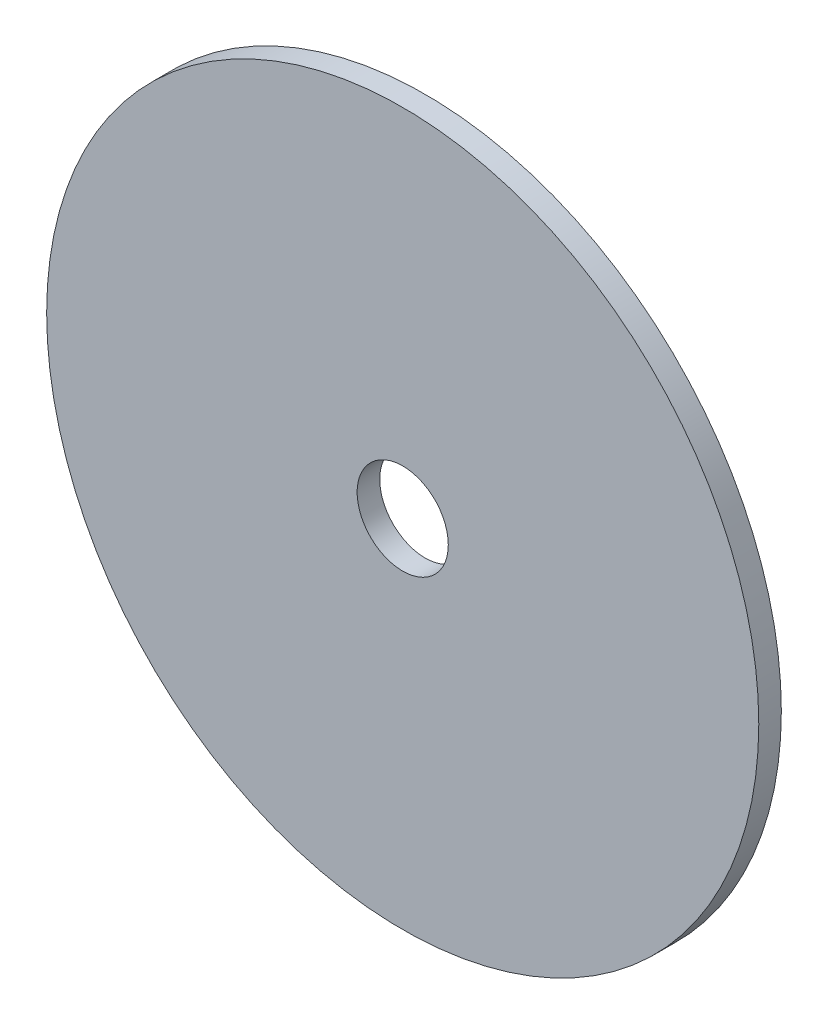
ISO-10303-21;
HEADER;
FILE_DESCRIPTION(('STEP AP214'),'2;1');
FILE_NAME('part.step','',(''),(''),'','','');
FILE_SCHEMA(('AUTOMOTIVE_DESIGN { 1 0 10303 214 1 1 1 1 }'));
ENDSEC;
DATA;
#1=APPLICATION_CONTEXT('core data for automotive mechanical design processes');
#2=APPLICATION_PROTOCOL_DEFINITION('international standard','automotive_design',2000,#1);
#3=PRODUCT_CONTEXT('',#1,'mechanical');
#4=PRODUCT('Part','Part','',(#3));
#5=PRODUCT_RELATED_PRODUCT_CATEGORY('part','',(#4));
#6=PRODUCT_DEFINITION_FORMATION('','',#4);
#7=PRODUCT_DEFINITION_CONTEXT('part definition',#1,'design');
#8=PRODUCT_DEFINITION('design','',#6,#7);
#9=PRODUCT_DEFINITION_SHAPE('','',#8);
#10=(LENGTH_UNIT() NAMED_UNIT(*) SI_UNIT(.MILLI.,.METRE.));
#11=(NAMED_UNIT(*) PLANE_ANGLE_UNIT() SI_UNIT($,.RADIAN.));
#12=(NAMED_UNIT(*) SI_UNIT($,.STERADIAN.) SOLID_ANGLE_UNIT());
#13=UNCERTAINTY_MEASURE_WITH_UNIT(LENGTH_MEASURE(1.E-05),#10,'distance_accuracy_value','');
#14=(GEOMETRIC_REPRESENTATION_CONTEXT(3) GLOBAL_UNCERTAINTY_ASSIGNED_CONTEXT((#13)) GLOBAL_UNIT_ASSIGNED_CONTEXT((#10,
#11,#12)) REPRESENTATION_CONTEXT('',''));
#15=CARTESIAN_POINT('',(0.,0.,0.));
#16=DIRECTION('',(0.,0.,1.));
#17=DIRECTION('',(1.,0.,0.));
#18=AXIS2_PLACEMENT_3D('',#15,#16,#17);
#19=CARTESIAN_POINT('',(0.,0.,1.5841));
#20=DIRECTION('',(0.,0.,1.));
#21=DIRECTION('',(1.,0.,0.));
#22=AXIS2_PLACEMENT_3D('',#19,#20,#21);
#23=PLANE('',#22);
#24=CARTESIAN_POINT('',(0.,0.,1.5841));
#25=DIRECTION('',(0.,0.,1.));
#26=DIRECTION('',(1.,0.,0.));
#27=AXIS2_PLACEMENT_3D('',#24,#25,#26);
#28=CIRCLE('',#27,25.);
#29=CARTESIAN_POINT('',(25.,0.,1.5841));
#30=VERTEX_POINT('',#29);
#31=EDGE_CURVE('E10',#30,#30,#28,.T.);
#32=ORIENTED_EDGE('',*,*,#31,.T.);
#33=EDGE_LOOP('',(#32));
#34=FACE_BOUND('',#33,.T.);
#35=CARTESIAN_POINT('',(0.,0.,1.5841));
#36=DIRECTION('',(0.,0.,1.));
#37=DIRECTION('',(1.,0.,0.));
#38=AXIS2_PLACEMENT_3D('',#35,#36,#37);
#39=CIRCLE('',#38,3.2);
#40=CARTESIAN_POINT('',(3.2,0.,1.5841));
#41=VERTEX_POINT('',#40);
#42=EDGE_CURVE('E50',#41,#41,#39,.T.);
#43=ORIENTED_EDGE('',*,*,#42,.F.);
#44=EDGE_LOOP('',(#43));
#45=FACE_BOUND('',#44,.T.);
#46=ADVANCED_FACE('F39',(#34,#45),#23,.T.);
#47=CARTESIAN_POINT('',(0.,0.,0.));
#48=DIRECTION('',(0.,0.,1.));
#49=DIRECTION('',(1.,0.,0.));
#50=AXIS2_PLACEMENT_3D('',#47,#48,#49);
#51=PLANE('',#50);
#52=CARTESIAN_POINT('',(0.,0.,0.));
#53=DIRECTION('',(0.,0.,1.));
#54=DIRECTION('',(1.,0.,0.));
#55=AXIS2_PLACEMENT_3D('',#52,#53,#54);
#56=CIRCLE('',#55,25.);
#57=CARTESIAN_POINT('',(25.,0.,0.));
#58=VERTEX_POINT('',#57);
#59=EDGE_CURVE('E43',#58,#58,#56,.T.);
#60=ORIENTED_EDGE('',*,*,#59,.F.);
#61=EDGE_LOOP('',(#60));
#62=FACE_BOUND('',#61,.T.);
#63=CARTESIAN_POINT('',(0.,0.,0.));
#64=DIRECTION('',(0.,0.,1.));
#65=DIRECTION('',(1.,0.,0.));
#66=AXIS2_PLACEMENT_3D('',#63,#64,#65);
#67=CIRCLE('',#66,3.2);
#68=CARTESIAN_POINT('',(3.2,0.,0.));
#69=VERTEX_POINT('',#68);
#70=EDGE_CURVE('E52',#69,#69,#67,.T.);
#71=ORIENTED_EDGE('',*,*,#70,.T.);
#72=EDGE_LOOP('',(#71));
#73=FACE_BOUND('',#72,.T.);
#74=ADVANCED_FACE('F62',(#62,#73),#51,.F.);
#75=CARTESIAN_POINT('',(0.,0.,1.5841));
#76=DIRECTION('',(0.,0.,-1.));
#77=DIRECTION('',(-1.,0.,0.));
#78=AXIS2_PLACEMENT_3D('',#75,#76,#77);
#79=CYLINDRICAL_SURFACE('',#78,25.);
#80=ORIENTED_EDGE('',*,*,#31,.F.);
#81=EDGE_LOOP('',(#80));
#82=FACE_BOUND('',#81,.T.);
#83=ORIENTED_EDGE('',*,*,#59,.T.);
#84=EDGE_LOOP('',(#83));
#85=FACE_BOUND('',#84,.T.);
#86=ADVANCED_FACE('F41',(#82,#85),#79,.T.);
#87=CARTESIAN_POINT('',(0.,0.,1.5841));
#88=DIRECTION('',(0.,0.,-1.));
#89=DIRECTION('',(-1.,0.,0.));
#90=AXIS2_PLACEMENT_3D('',#87,#88,#89);
#91=CYLINDRICAL_SURFACE('',#90,3.2);
#92=ORIENTED_EDGE('',*,*,#42,.T.);
#93=EDGE_LOOP('',(#92));
#94=FACE_BOUND('',#93,.T.);
#95=ORIENTED_EDGE('',*,*,#70,.F.);
#96=EDGE_LOOP('',(#95));
#97=FACE_BOUND('',#96,.T.);
#98=ADVANCED_FACE('F58',(#94,#97),#91,.F.);
#99=CLOSED_SHELL('',(#46,#74,#86,#98));
#100=MANIFOLD_SOLID_BREP('B2',#99);
#101=ADVANCED_BREP_SHAPE_REPRESENTATION('',(#18,#100),#14);
#102=SHAPE_DEFINITION_REPRESENTATION(#9,#101);
ENDSEC;
END-ISO-10303-21;
